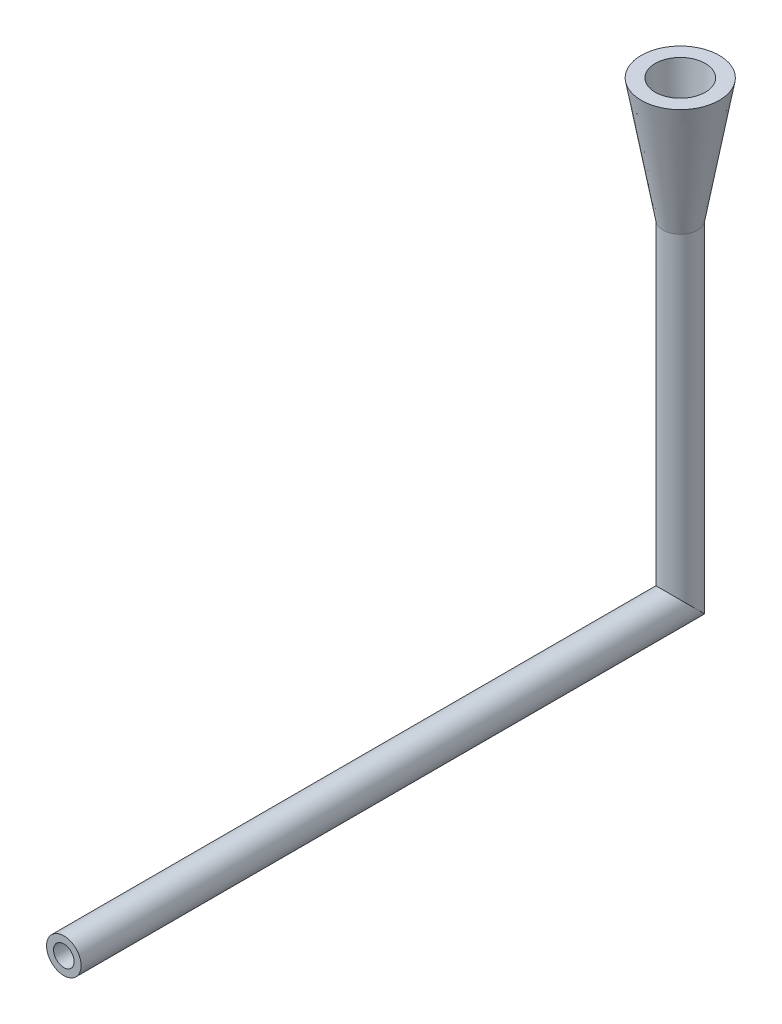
from build123d import *

# Parameters (mm, degrees)
SKETCH1_R           = 10.668
SKETCH1_R_2         = 6.35
SKETCH3_R           = 10.668
BOSS_EXTRUDE1_DEPTH = 76.2
BOSS_EXTRUDE1_DRAFT = -10
SKETCH5_R           = 15.46811593
CUT_EXTRUDE1_DEPTH  = 76.2
CUT_EXTRUDE1_DRAFT  = -6


with BuildPart() as part:
    # Sweep1: sweep along a path in Sketch2
    with BuildLine(Plane(origin=(0, 0, 0), x_dir=(0, 0, -1), z_dir=(1, 0, 0))) as sweep1_path:
        Line((0, 0), (381, 0))
        Line((381, 0), (381, 203.2))
    # Sketch1 → Sweep1 (sweep)
    with BuildSketch(Plane.XY):
        Circle(SKETCH1_R)
        Circle(SKETCH1_R_2, mode=Mode.SUBTRACT)
    sweep(path=sweep1_path.line, transition=Transition.RIGHT)


with BuildPart() as boss_extrude1_tool:
    # Sketch3 → Boss-Extrude1 (with draft: the straight prism first)
    with BuildSketch(Plane(origin=(0, 203.2, 0), x_dir=(1, 0, 0), z_dir=(0, 1, 0))):
        with Locations(Location((0, 381, 0), (0, 0, 270))):
            Circle(SKETCH3_R)
    extrude(amount=BOSS_EXTRUDE1_DEPTH)
    # Boss-Extrude1: the draft: its side faces are tilted about the plane it starts from
    boss_extrude1_sides = [boss_extrude1_tool.faces().sort_by_distance(p)[0] for p in [
        (0, 241.3, -391.668),
    ]]
    draft(boss_extrude1_sides, Plane(origin=(0, 203.2, 0), x_dir=(1, 0, 0), z_dir=(0, 1, 0)), BOSS_EXTRUDE1_DRAFT)


with BuildPart() as part_1:
    add(part.part)

    # Boss-Extrude1: add boss_extrude1_tool
    add(boss_extrude1_tool.part)


with BuildPart() as cut_extrude1_tool:
    # Sketch5 → Cut-Extrude1 (with draft: the straight prism first)
    with BuildSketch(Plane(origin=(0, 279.4, 0), x_dir=(1, 0, 0), z_dir=(0, 1, 0))):
        with Locations((0, 381)):
            Circle(SKETCH5_R)
    extrude(amount=-CUT_EXTRUDE1_DEPTH)
    # Cut-Extrude1: the draft: its side faces are tilted about the plane it starts from
    cut_extrude1_sides = [cut_extrude1_tool.faces().sort_by_distance(p)[0] for p in [
        (-15.46811593, 241.3, -381),
    ]]
    draft(cut_extrude1_sides, Plane(origin=(0, 279.4, 0), x_dir=(1, 0, 0), z_dir=(0, 1, 0)), CUT_EXTRUDE1_DRAFT)


with BuildPart() as part_2:
    add(part_1.part)

    # Cut-Extrude1: cut by cut_extrude1_tool
    add(cut_extrude1_tool.part, mode=Mode.SUBTRACT)


solid = part_2.part
